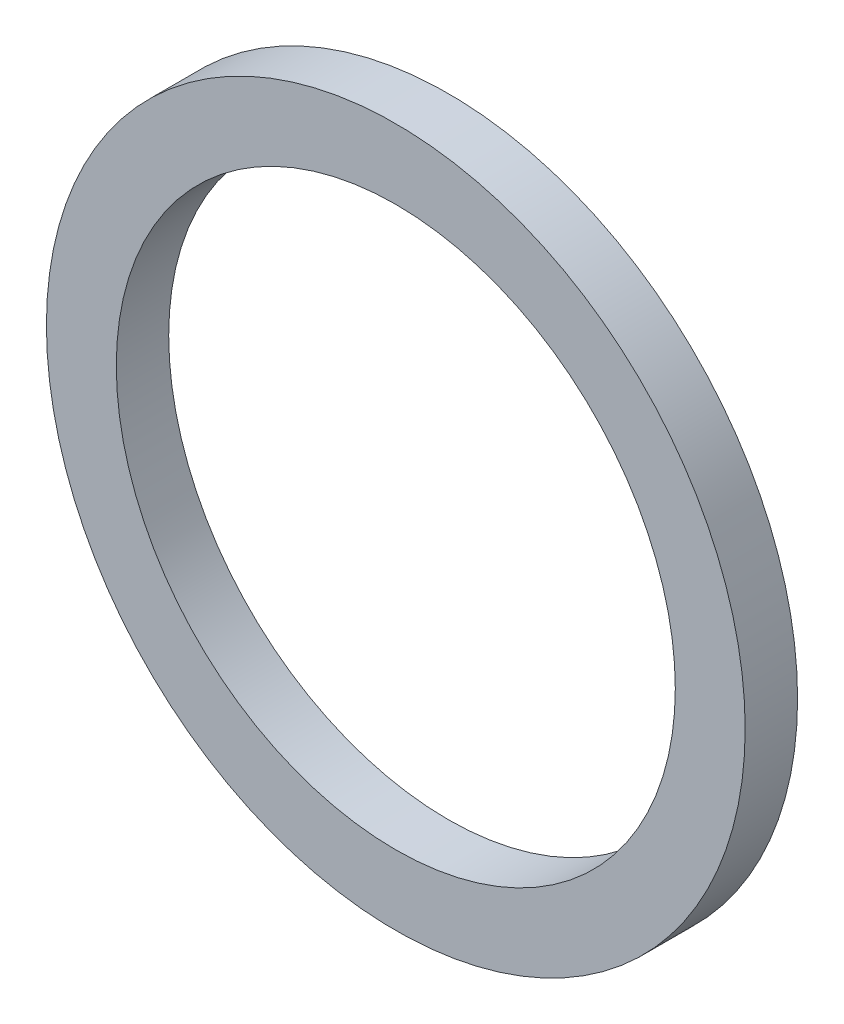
from build123d import *

# Parameters (mm, degrees)
ESQUISSE1_R          = 20
ESQUISSE1_R_2        = 16
BASE_EXTRUSION_DEPTH = 3


with BuildPart() as part:
    # Esquisse1 → Base-Extrusion (new body)
    with BuildSketch(Plane.XY):
        Circle(ESQUISSE1_R)
        Circle(ESQUISSE1_R_2, mode=Mode.SUBTRACT)
    extrude(amount=BASE_EXTRUSION_DEPTH)


solid = part.part
